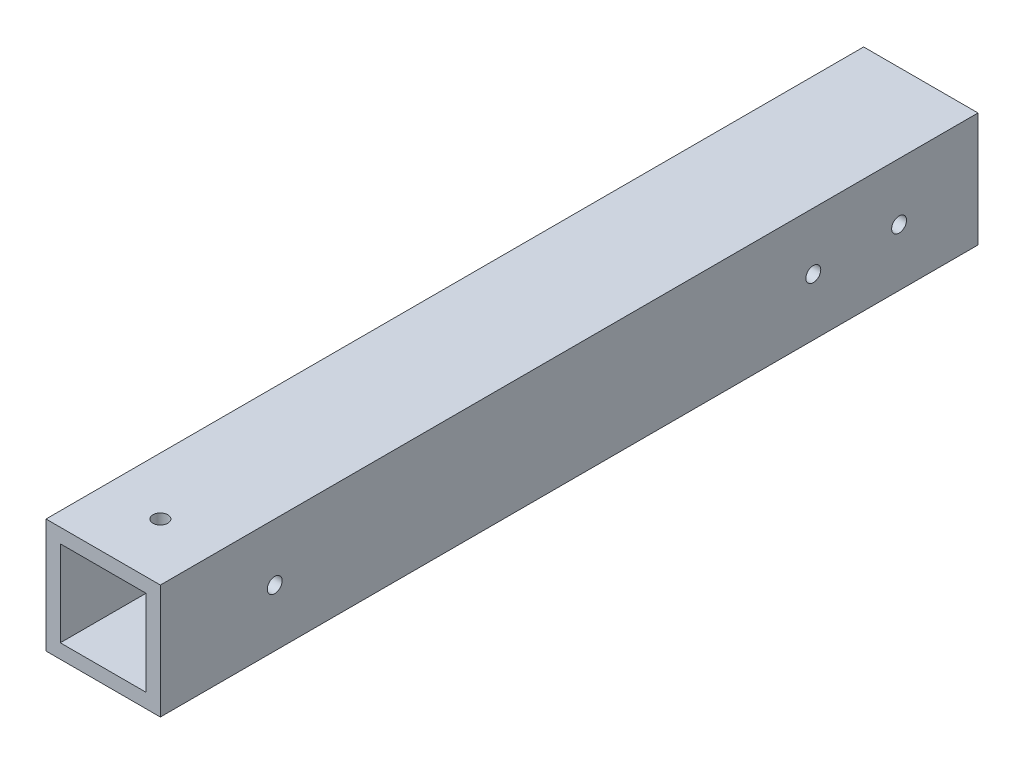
from build123d import *

# Parameters (mm, degrees)
SKETCH1_W           = 50.8
SKETCH1_H           = 50.8
SKETCH1_W_2         = 38.1
SKETCH1_H_2         = 38.1
BOSS_EXTRUDE1_DEPTH = 363.22
SKETCH3_R           = 3.302
HOLD_DOWN_DEPTH     = 371.256733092
SKETCH4_R           = 3.302
CUT_EXTRUDE1_DEPTH  = 371.256733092


with BuildPart() as part:
    # Sketch1 → Boss-Extrude1 (new body)
    with BuildSketch(Plane.XY):
        with Locations((25.4, 25.4)):
            Rectangle(SKETCH1_W, SKETCH1_H)
        with Locations((25.4, 25.4)):
            Rectangle(SKETCH1_W_2, SKETCH1_H_2, mode=Mode.SUBTRACT)
    extrude(amount=-BOSS_EXTRUDE1_DEPTH)

    # Sketch3 → hold down (cut, through all)
    with BuildSketch(Plane(origin=(0, 50.8, 0), x_dir=(1, 0, 0), z_dir=(0, 1, 0))):
        with Locations(Location((25.4, 25.4, 0), (0, 0, 270))):
            Circle(SKETCH3_R)
    extrude(amount=-HOLD_DOWN_DEPTH, mode=Mode.SUBTRACT)

    # Sketch4 → Cut-Extrude1 (cut, through all)
    with BuildSketch(Plane(origin=(50.8, 0, 0), x_dir=(0, 0, -1), z_dir=(1, 0, 0))):
        with Locations((50.8, 25.4)):
            Circle(SKETCH4_R)
        with Locations((290.068, 25.4)):
            Circle(SKETCH4_R)
        with Locations((328.168, 25.4)):
            Circle(SKETCH4_R)
    extrude(amount=-CUT_EXTRUDE1_DEPTH, mode=Mode.SUBTRACT)


solid = part.part
